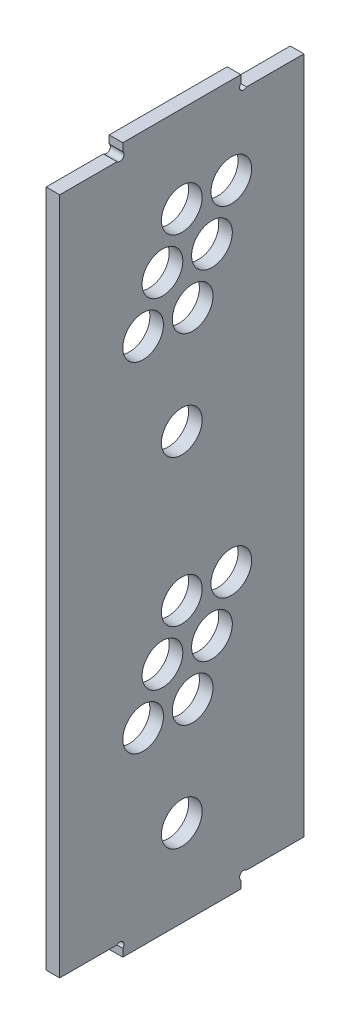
from build123d import *

# Parameters (mm, degrees)
CROQUIS3_W              = 180
CROQUIS3_H              = 500
SALIENTE_EXTRUIR1_DEPTH = 10
CROQUIS5_R              = 15
CORTAR_EXTRUIR2_DEPTH   = 532.507290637
MATRIZL1_COUNT          = 2
MATRIZL1_PITCH          = 250
CROQUIS6_W              = 10
CROQUIS6_H              = 87
SALIENTE_EXTRUIR2_DEPTH = 10
CROQUIS7_R              = 3
CORTAR_EXTRUIR3_DEPTH   = 532.507290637


with BuildPart() as part:
    # Croquis3 → Saliente-Extruir1 (new body)
    with BuildSketch(Plane.ZY.offset(182.695207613)):
        with Locations((-90, 250)):
            Rectangle(CROQUIS3_W, CROQUIS3_H)
    extrude(amount=SALIENTE_EXTRUIR1_DEPTH)

    # Croquis5 → Cortar-Extruir2 (cut, symmetric)
    with BuildSketch(Plane.ZY.offset(192.695207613)):
        with Locations((-90, 54)):
            Circle(CROQUIS5_R)
        with Locations((-98, 129)):
            Circle(CROQUIS5_R)
        with Locations((-112.25, 162.5)):
            Circle(CROQUIS5_R)
        with Locations((-126.5, 196)):
            Circle(CROQUIS5_R)
        with Locations((-75.75, 162.5)):
            Circle(CROQUIS5_R)
        with Locations((-90, 196)):
            Circle(CROQUIS5_R)
        with Locations((-61.5, 129)):
            Circle(CROQUIS5_R)
    cortar_extruir2 = extrude(amount=CORTAR_EXTRUIR2_DEPTH, both=True, mode=Mode.SUBTRACT)

    # MatrizL1: Cortar-Extruir2 ×2
    with Locations(*[(0, i * MATRIZL1_PITCH, 0) for i in range(1, MATRIZL1_COUNT)]):
        add(cortar_extruir2, mode=Mode.SUBTRACT)

    # Croquis6 → Saliente-Extruir2 (add)
    with BuildSketch(Plane.XZ):
        with Locations((-187.695207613, -90)):
            Rectangle(CROQUIS6_W, CROQUIS6_H)
    saliente_extruir2 = extrude(amount=SALIENTE_EXTRUIR2_DEPTH)

    # Croquis7 → Cortar-Extruir3 (cut, through all)
    with BuildSketch(Plane.ZY.offset(192.695207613)):
        with Locations((-135.621320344, -2.121320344)):
            Circle(CROQUIS7_R)
        with Locations((-44.378679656, -2.121320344)):
            Circle(CROQUIS7_R)
    cortar_extruir3 = extrude(amount=-CORTAR_EXTRUIR3_DEPTH, mode=Mode.SUBTRACT)

    # Simetr_a1: Saliente-Extruir2, Cortar-Extruir3 across plane
    add(saliente_extruir2.mirror(Plane(origin=(0, 250, 0), x_dir=(0, 0, 1), z_dir=(0, -1, 0))))
    add(cortar_extruir3.mirror(Plane(origin=(0, 250, 0), x_dir=(0, 0, 1), z_dir=(0, -1, 0))), mode=Mode.SUBTRACT)


solid = part.part
